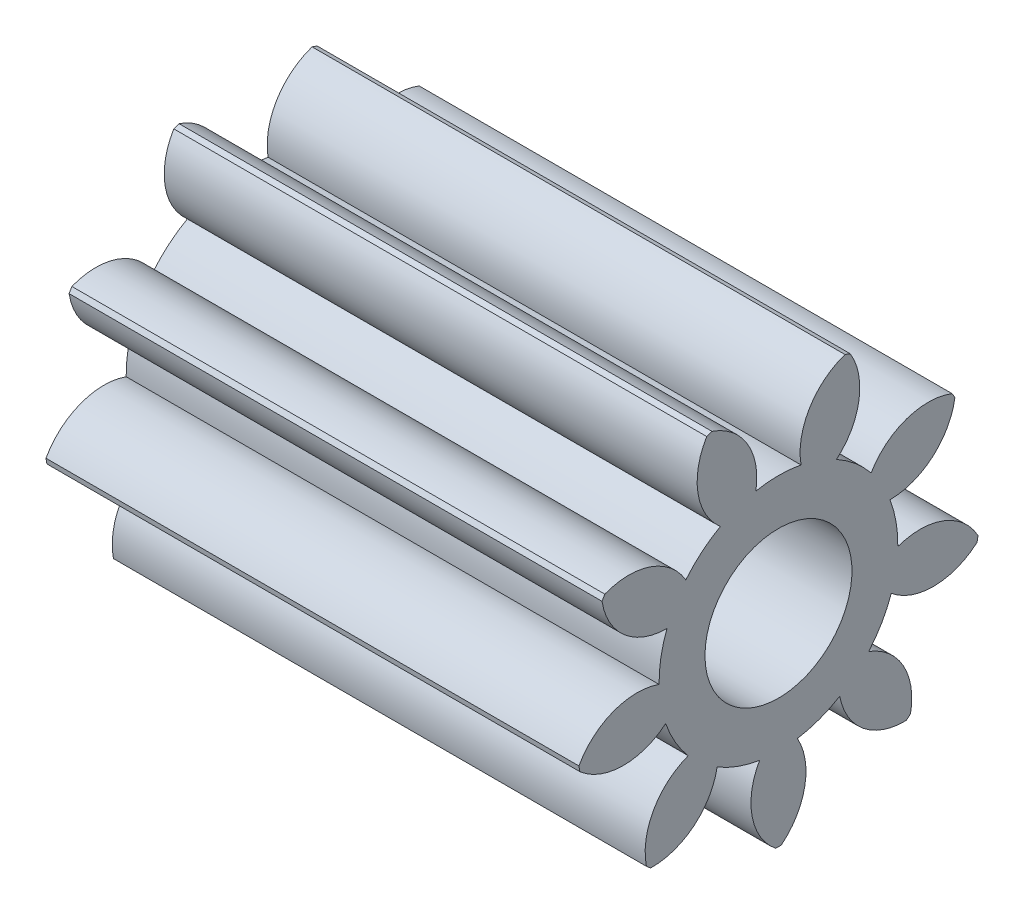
ISO-10303-21;
HEADER;
FILE_DESCRIPTION(('STEP AP214'),'2;1');
FILE_NAME('part.step','',(''),(''),'','','');
FILE_SCHEMA(('AUTOMOTIVE_DESIGN { 1 0 10303 214 1 1 1 1 }'));
ENDSEC;
DATA;
#1=APPLICATION_CONTEXT('core data for automotive mechanical design processes');
#2=APPLICATION_PROTOCOL_DEFINITION('international standard','automotive_design',2000,#1);
#3=PRODUCT_CONTEXT('',#1,'mechanical');
#4=PRODUCT('Part','Part','',(#3));
#5=PRODUCT_RELATED_PRODUCT_CATEGORY('part','',(#4));
#6=PRODUCT_DEFINITION_FORMATION('','',#4);
#7=PRODUCT_DEFINITION_CONTEXT('part definition',#1,'design');
#8=PRODUCT_DEFINITION('design','',#6,#7);
#9=PRODUCT_DEFINITION_SHAPE('','',#8);
#10=(LENGTH_UNIT() NAMED_UNIT(*) SI_UNIT(.MILLI.,.METRE.));
#11=(NAMED_UNIT(*) PLANE_ANGLE_UNIT() SI_UNIT($,.RADIAN.));
#12=(NAMED_UNIT(*) SI_UNIT($,.STERADIAN.) SOLID_ANGLE_UNIT());
#13=UNCERTAINTY_MEASURE_WITH_UNIT(LENGTH_MEASURE(1.E-05),#10,'distance_accuracy_value','');
#14=(GEOMETRIC_REPRESENTATION_CONTEXT(3) GLOBAL_UNCERTAINTY_ASSIGNED_CONTEXT((#13)) GLOBAL_UNIT_ASSIGNED_CONTEXT((#10,
#11,#12)) REPRESENTATION_CONTEXT('',''));
#15=CARTESIAN_POINT('',(0.,0.,0.));
#16=DIRECTION('',(0.,0.,1.));
#17=DIRECTION('',(1.,0.,0.));
#18=AXIS2_PLACEMENT_3D('',#15,#16,#17);
#19=CARTESIAN_POINT('',(7.25,0.,0.));
#20=DIRECTION('',(-1.,0.,0.));
#21=DIRECTION('',(0.,0.,1.));
#22=AXIS2_PLACEMENT_3D('',#19,#20,#21);
#23=PLANE('',#22);
#24=CARTESIAN_POINT('',(7.25,0.568726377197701,-2.03638166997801));
#25=DIRECTION('',(-1.,0.,0.));
#26=DIRECTION('',(0.,-0.64278760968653,-0.766044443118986));
#27=AXIS2_PLACEMENT_3D('',#24,#25,#26);
#28=CIRCLE('',#27,0.899999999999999);
#29=CARTESIAN_POINT('',(7.25,1.02432064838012,-1.26021554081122));
#30=VERTEX_POINT('',#29);
#31=CARTESIAN_POINT('',(7.25,1.4075779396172,-2.36246150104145));
#32=VERTEX_POINT('',#31);
#33=EDGE_CURVE('E276',#30,#32,#28,.T.);
#34=ORIENTED_EDGE('',*,*,#33,.F.);
#35=CARTESIAN_POINT('',(7.25,0.,0.));
#36=DIRECTION('',(-1.,0.,0.));
#37=DIRECTION('',(0.,-0.64278760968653,-0.766044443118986));
#38=AXIS2_PLACEMENT_3D('',#35,#36,#37);
#39=CIRCLE('',#38,1.624);
#40=CARTESIAN_POINT('',(7.25,1.4189414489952,-0.78992478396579));
#41=VERTEX_POINT('',#40);
#42=EDGE_CURVE('E477',#41,#30,#39,.T.);
#43=ORIENTED_EDGE('',*,*,#42,.F.);
#44=CARTESIAN_POINT('',(7.25,2.1042027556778,-0.206472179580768));
#45=DIRECTION('',(-1.,0.,0.));
#46=DIRECTION('',(0.,-0.64278760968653,-0.766044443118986));
#47=AXIS2_PLACEMENT_3D('',#44,#45,#46);
#48=CIRCLE('',#47,0.899999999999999);
#49=CARTESIAN_POINT('',(7.25,2.5709937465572,-0.975956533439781));
#50=VERTEX_POINT('',#49);
#51=EDGE_CURVE('E266',#50,#41,#48,.T.);
#52=ORIENTED_EDGE('',*,*,#51,.F.);
#53=CARTESIAN_POINT('',(7.25,0.,0.));
#54=DIRECTION('',(-1.,0.,0.));
#55=DIRECTION('',(0.,0.,1.));
#56=AXIS2_PLACEMENT_3D('',#53,#54,#55);
#57=CIRCLE('',#56,2.75);
#58=CARTESIAN_POINT('',(7.25,2.59682824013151,-0.904976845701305));
#59=VERTEX_POINT('',#58);
#60=EDGE_CURVE('E294',#59,#50,#57,.T.);
#61=ORIENTED_EDGE('',*,*,#60,.F.);
#62=CARTESIAN_POINT('',(7.25,1.74463058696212,-1.19438859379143));
#63=DIRECTION('',(-1.,0.,0.));
#64=DIRECTION('',(0.,0.,-1.));
#65=AXIS2_PLACEMENT_3D('',#62,#63,#64);
#66=CIRCLE('',#65,0.899999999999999);
#67=CARTESIAN_POINT('',(7.25,1.59472607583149,-0.306960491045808));
#68=VERTEX_POINT('',#67);
#69=EDGE_CURVE('E318',#68,#59,#66,.T.);
#70=ORIENTED_EDGE('',*,*,#69,.F.);
#71=CARTESIAN_POINT('',(7.25,0.,0.));
#72=DIRECTION('',(-1.,0.,0.));
#73=DIRECTION('',(0.,0.,-1.));
#74=AXIS2_PLACEMENT_3D('',#71,#72,#73);
#75=CIRCLE('',#74,1.624);
#76=CARTESIAN_POINT('',(7.25,1.59472607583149,0.306960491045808));
#77=VERTEX_POINT('',#76);
#78=EDGE_CURVE('E314',#77,#68,#75,.T.);
#79=ORIENTED_EDGE('',*,*,#78,.F.);
#80=CARTESIAN_POINT('',(7.25,1.74463058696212,1.19438859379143));
#81=DIRECTION('',(-1.,0.,0.));
#82=DIRECTION('',(0.,0.,-1.));
#83=AXIS2_PLACEMENT_3D('',#80,#81,#82);
#84=CIRCLE('',#83,0.899999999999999);
#85=CARTESIAN_POINT('',(7.25,2.59682824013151,0.904976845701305));
#86=VERTEX_POINT('',#85);
#87=EDGE_CURVE('E316',#86,#77,#84,.T.);
#88=ORIENTED_EDGE('',*,*,#87,.F.);
#89=CARTESIAN_POINT('',(7.25,2.57099374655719,0.975956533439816));
#90=VERTEX_POINT('',#89);
#91=EDGE_CURVE('E288',#90,#86,#57,.T.);
#92=ORIENTED_EDGE('',*,*,#91,.F.);
#93=CARTESIAN_POINT('',(7.25,2.10420275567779,0.206472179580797));
#94=DIRECTION('',(-1.,0.,0.));
#95=DIRECTION('',(0.,0.642787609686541,-0.766044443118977));
#96=AXIS2_PLACEMENT_3D('',#93,#94,#95);
#97=CIRCLE('',#96,0.899999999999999);
#98=CARTESIAN_POINT('',(7.25,1.41894144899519,0.789924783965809));
#99=VERTEX_POINT('',#98);
#100=EDGE_CURVE('E337',#99,#90,#97,.T.);
#101=ORIENTED_EDGE('',*,*,#100,.F.);
#102=CARTESIAN_POINT('',(7.25,0.,0.));
#103=DIRECTION('',(-1.,0.,0.));
#104=DIRECTION('',(0.,0.642787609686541,-0.766044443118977));
#105=AXIS2_PLACEMENT_3D('',#102,#103,#104);
#106=CIRCLE('',#105,1.624);
#107=CARTESIAN_POINT('',(7.25,1.02432064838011,1.26021554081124));
#108=VERTEX_POINT('',#107);
#109=EDGE_CURVE('E333',#108,#99,#106,.T.);
#110=ORIENTED_EDGE('',*,*,#109,.F.);
#111=CARTESIAN_POINT('',(7.25,0.568726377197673,2.03638166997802));
#112=DIRECTION('',(-1.,0.,0.));
#113=DIRECTION('',(0.,0.642787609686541,-0.766044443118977));
#114=AXIS2_PLACEMENT_3D('',#111,#112,#113);
#115=CIRCLE('',#114,0.899999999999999);
#116=CARTESIAN_POINT('',(7.25,1.40757793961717,2.36246150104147));
#117=VERTEX_POINT('',#116);
#118=EDGE_CURVE('E335',#117,#108,#115,.T.);
#119=ORIENTED_EDGE('',*,*,#118,.F.);
#120=CARTESIAN_POINT('',(7.25,1.34216270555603,2.40022900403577));
#121=VERTEX_POINT('',#120);
#122=EDGE_CURVE('E292',#121,#117,#57,.T.);
#123=ORIENTED_EDGE('',*,*,#122,.F.);
#124=CARTESIAN_POINT('',(7.25,1.4791950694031,1.51072232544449));
#125=DIRECTION('',(-1.,0.,0.));
#126=DIRECTION('',(0.,0.984807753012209,-0.173648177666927));
#127=AXIS2_PLACEMENT_3D('',#124,#125,#126);
#128=CIRCLE('',#127,0.899999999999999);
#129=CARTESIAN_POINT('',(7.25,0.579218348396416,1.51719547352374));
#130=VERTEX_POINT('',#129);
#131=EDGE_CURVE('E358',#130,#121,#128,.T.);
#132=ORIENTED_EDGE('',*,*,#131,.F.);
#133=CARTESIAN_POINT('',(7.25,0.,0.));
#134=DIRECTION('',(-1.,0.,0.));
#135=DIRECTION('',(0.,0.984807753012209,-0.173648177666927));
#136=AXIS2_PLACEMENT_3D('',#133,#134,#135);
#137=CIRCLE('',#136,1.624);
#138=CARTESIAN_POINT('',(7.25,-0.0253757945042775,1.62380173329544));
#139=VERTEX_POINT('',#138);
#140=EDGE_CURVE('E354',#139,#130,#137,.T.);
#141=ORIENTED_EDGE('',*,*,#140,.F.);
#142=CARTESIAN_POINT('',(7.25,-0.873291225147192,1.92552913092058));
#143=DIRECTION('',(-1.,0.,0.));
#144=DIRECTION('',(0.,0.984807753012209,-0.173648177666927));
#145=AXIS2_PLACEMENT_3D('',#142,#143,#144);
#146=CIRCLE('',#145,0.899999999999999);
#147=CARTESIAN_POINT('',(7.25,-0.440293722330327,2.71452416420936));
#148=VERTEX_POINT('',#147);
#149=EDGE_CURVE('E356',#148,#139,#146,.T.);
#150=ORIENTED_EDGE('',*,*,#149,.F.);
#151=CARTESIAN_POINT('',(7.25,-0.514681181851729,2.70140764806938));
#152=VERTEX_POINT('',#151);
#153=EDGE_CURVE('E583',#152,#148,#57,.T.);
#154=ORIENTED_EDGE('',*,*,#153,.F.);
#155=CARTESIAN_POINT('',(7.25,0.162055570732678,2.10808870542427));
#156=DIRECTION('',(-1.,0.,0.));
#157=DIRECTION('',(0.,0.866025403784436,0.500000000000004));
#158=AXIS2_PLACEMENT_3D('',#155,#156,#157);
#159=CIRCLE('',#158,0.899999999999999);
#160=CARTESIAN_POINT('',(7.25,-0.531527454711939,1.53455353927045));
#161=VERTEX_POINT('',#160);
#162=EDGE_CURVE('E380',#161,#152,#159,.T.);
#163=ORIENTED_EDGE('',*,*,#162,.F.);
#164=CARTESIAN_POINT('',(7.25,0.,0.));
#165=DIRECTION('',(-1.,0.,0.));
#166=DIRECTION('',(0.,0.866025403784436,0.500000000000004));
#167=AXIS2_PLACEMENT_3D('',#164,#165,#166);
#168=CIRCLE('',#167,1.624);
#169=CARTESIAN_POINT('',(7.25,-1.06319862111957,1.22759304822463));
#170=VERTEX_POINT('',#169);
#171=EDGE_CURVE('E376',#170,#161,#168,.T.);
#172=ORIENTED_EDGE('',*,*,#171,.F.);
#173=CARTESIAN_POINT('',(7.25,-1.90668615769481,0.913700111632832));
#174=DIRECTION('',(-1.,0.,0.));
#175=DIRECTION('',(0.,0.866025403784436,0.500000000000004));
#176=AXIS2_PLACEMENT_3D('',#173,#174,#175);
#177=CIRCLE('',#176,0.899999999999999);
#178=CARTESIAN_POINT('',(7.25,-2.0821470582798,1.79643080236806));
#179=VERTEX_POINT('',#178);
#180=EDGE_CURVE('E378',#179,#170,#177,.T.);
#181=ORIENTED_EDGE('',*,*,#180,.F.);
#182=CARTESIAN_POINT('',(7.25,-2.13070002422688,1.73856763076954));
#183=VERTEX_POINT('',#182);
#184=EDGE_CURVE('E578',#183,#179,#57,.T.);
#185=ORIENTED_EDGE('',*,*,#184,.F.);
#186=CARTESIAN_POINT('',(7.25,-1.23091153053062,1.71905695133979));
#187=DIRECTION('',(-1.,0.,0.));
#188=DIRECTION('',(0.,0.342020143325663,0.939692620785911));
#189=AXIS2_PLACEMENT_3D('',#186,#187,#188);
#190=CIRCLE('',#189,0.899999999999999);
#191=CARTESIAN_POINT('',(7.25,-1.39356565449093,0.833876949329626));
#192=VERTEX_POINT('',#191);
#193=EDGE_CURVE('E402',#192,#183,#190,.T.);
#194=ORIENTED_EDGE('',*,*,#193,.F.);
#195=CARTESIAN_POINT('',(7.25,0.,0.));
#196=DIRECTION('',(-1.,0.,0.));
#197=DIRECTION('',(0.,0.342020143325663,0.939692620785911));
#198=AXIS2_PLACEMENT_3D('',#195,#196,#197);
#199=CIRCLE('',#198,1.624);
#200=CARTESIAN_POINT('',(7.25,-1.60353899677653,0.256979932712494));
#201=VERTEX_POINT('',#200);
#202=EDGE_CURVE('E398',#201,#192,#199,.T.);
#203=ORIENTED_EDGE('',*,*,#202,.F.);
#204=CARTESIAN_POINT('',(7.25,-2.04792144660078,-0.525659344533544));
#205=DIRECTION('',(-1.,0.,0.));
#206=DIRECTION('',(0.,0.342020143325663,0.939692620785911));
#207=AXIS2_PLACEMENT_3D('',#204,#205,#206);
#208=CIRCLE('',#207,0.899999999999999);
#209=CARTESIAN_POINT('',(7.25,-2.74974064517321,0.0377675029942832));
#210=VERTEX_POINT('',#209);
#211=EDGE_CURVE('E400',#210,#201,#208,.T.);
#212=ORIENTED_EDGE('',*,*,#211,.F.);
#213=CARTESIAN_POINT('',(7.25,-2.74974064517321,-0.0377675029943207));
#214=VERTEX_POINT('',#213);
#215=EDGE_CURVE('E573',#214,#210,#57,.T.);
#216=ORIENTED_EDGE('',*,*,#215,.F.);
#217=CARTESIAN_POINT('',(7.25,-2.04792144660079,0.525659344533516));
#218=DIRECTION('',(-1.,0.,0.));
#219=DIRECTION('',(0.,-0.342020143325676,0.939692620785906));
#220=AXIS2_PLACEMENT_3D('',#217,#218,#219);
#221=CIRCLE('',#220,0.899999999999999);
#222=CARTESIAN_POINT('',(7.25,-1.60353899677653,-0.256979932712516));
#223=VERTEX_POINT('',#222);
#224=EDGE_CURVE('E424',#223,#214,#221,.T.);
#225=ORIENTED_EDGE('',*,*,#224,.F.);
#226=CARTESIAN_POINT('',(7.25,0.,0.));
#227=DIRECTION('',(-1.,0.,0.));
#228=DIRECTION('',(0.,-0.342020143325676,0.939692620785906));
#229=AXIS2_PLACEMENT_3D('',#226,#227,#228);
#230=CIRCLE('',#229,1.624);
#231=CARTESIAN_POINT('',(7.25,-1.39356565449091,-0.833876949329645));
#232=VERTEX_POINT('',#231);
#233=EDGE_CURVE('E420',#232,#223,#230,.T.);
#234=ORIENTED_EDGE('',*,*,#233,.F.);
#235=CARTESIAN_POINT('',(7.25,-1.23091153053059,-1.7190569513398));
#236=DIRECTION('',(-1.,0.,0.));
#237=DIRECTION('',(0.,-0.342020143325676,0.939692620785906));
#238=AXIS2_PLACEMENT_3D('',#235,#236,#237);
#239=CIRCLE('',#238,0.899999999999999);
#240=CARTESIAN_POINT('',(7.25,-2.13070002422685,-1.73856763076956));
#241=VERTEX_POINT('',#240);
#242=EDGE_CURVE('E422',#241,#232,#239,.T.);
#243=ORIENTED_EDGE('',*,*,#242,.F.);
#244=CARTESIAN_POINT('',(7.25,-2.08214705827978,-1.79643080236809));
#245=VERTEX_POINT('',#244);
#246=EDGE_CURVE('E568',#245,#241,#57,.T.);
#247=ORIENTED_EDGE('',*,*,#246,.F.);
#248=CARTESIAN_POINT('',(7.25,-1.9066861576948,-0.913700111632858));
#249=DIRECTION('',(-1.,0.,0.));
#250=DIRECTION('',(0.,-0.866025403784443,0.499999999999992));
#251=AXIS2_PLACEMENT_3D('',#248,#249,#250);
#252=CIRCLE('',#251,0.899999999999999);
#253=CARTESIAN_POINT('',(7.25,-1.06319862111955,-1.22759304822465));
#254=VERTEX_POINT('',#253);
#255=EDGE_CURVE('E446',#254,#245,#252,.T.);
#256=ORIENTED_EDGE('',*,*,#255,.F.);
#257=CARTESIAN_POINT('',(7.25,0.,0.));
#258=DIRECTION('',(-1.,0.,0.));
#259=DIRECTION('',(0.,-0.866025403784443,0.499999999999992));
#260=AXIS2_PLACEMENT_3D('',#257,#258,#259);
#261=CIRCLE('',#260,1.624);
#262=CARTESIAN_POINT('',(7.25,-0.531527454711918,-1.53455353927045));
#263=VERTEX_POINT('',#262);
#264=EDGE_CURVE('E442',#263,#254,#261,.T.);
#265=ORIENTED_EDGE('',*,*,#264,.F.);
#266=CARTESIAN_POINT('',(7.25,0.162055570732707,-2.10808870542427));
#267=DIRECTION('',(-1.,0.,0.));
#268=DIRECTION('',(0.,-0.866025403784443,0.499999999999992));
#269=AXIS2_PLACEMENT_3D('',#266,#267,#268);
#270=CIRCLE('',#269,0.899999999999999);
#271=CARTESIAN_POINT('',(7.25,-0.514681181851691,-2.70140764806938));
#272=VERTEX_POINT('',#271);
#273=EDGE_CURVE('E444',#272,#263,#270,.T.);
#274=ORIENTED_EDGE('',*,*,#273,.F.);
#275=CARTESIAN_POINT('',(7.25,-0.440293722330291,-2.71452416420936));
#276=VERTEX_POINT('',#275);
#277=EDGE_CURVE('E567',#276,#272,#57,.T.);
#278=ORIENTED_EDGE('',*,*,#277,.F.);
#279=CARTESIAN_POINT('',(7.25,-0.873291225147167,-1.92552913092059));
#280=DIRECTION('',(-1.,0.,0.));
#281=DIRECTION('',(0.,-0.984807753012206,-0.17364817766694));
#282=AXIS2_PLACEMENT_3D('',#279,#280,#281);
#283=CIRCLE('',#282,0.899999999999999);
#284=CARTESIAN_POINT('',(7.25,-0.0253757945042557,-1.62380173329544));
#285=VERTEX_POINT('',#284);
#286=EDGE_CURVE('E467',#285,#276,#283,.T.);
#287=ORIENTED_EDGE('',*,*,#286,.F.);
#288=CARTESIAN_POINT('',(7.25,0.,0.));
#289=DIRECTION('',(-1.,0.,0.));
#290=DIRECTION('',(0.,-0.984807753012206,-0.17364817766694));
#291=AXIS2_PLACEMENT_3D('',#288,#289,#290);
#292=CIRCLE('',#291,1.624);
#293=CARTESIAN_POINT('',(7.25,0.579218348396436,-1.51719547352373));
#294=VERTEX_POINT('',#293);
#295=EDGE_CURVE('E463',#294,#285,#292,.T.);
#296=ORIENTED_EDGE('',*,*,#295,.F.);
#297=CARTESIAN_POINT('',(7.25,1.47919506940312,-1.51072232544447));
#298=DIRECTION('',(-1.,0.,0.));
#299=DIRECTION('',(0.,-0.984807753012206,-0.17364817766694));
#300=AXIS2_PLACEMENT_3D('',#297,#298,#299);
#301=CIRCLE('',#300,0.899999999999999);
#302=CARTESIAN_POINT('',(7.25,1.34216270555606,-2.40022900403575));
#303=VERTEX_POINT('',#302);
#304=EDGE_CURVE('E465',#303,#294,#301,.T.);
#305=ORIENTED_EDGE('',*,*,#304,.F.);
#306=EDGE_CURVE('E540',#32,#303,#57,.T.);
#307=ORIENTED_EDGE('',*,*,#306,.F.);
#308=EDGE_LOOP('',(#34,#43,#52,#61,#70,#79,#88,#92,#101,#110,#119,#123,#132,#141,#150,#154,#163,
#172,#181,#185,#194,#203,#212,#216,#225,#234,#243,#247,#256,#265,#274,#278,#287,#296,#305,#307));
#309=FACE_BOUND('',#308,.T.);
#310=CARTESIAN_POINT('',(7.25,0.,0.));
#311=DIRECTION('',(-1.,0.,0.));
#312=DIRECTION('',(0.,0.,1.));
#313=AXIS2_PLACEMENT_3D('',#310,#311,#312);
#314=CIRCLE('',#313,0.999999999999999);
#315=CARTESIAN_POINT('',(7.25,0.,0.999999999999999));
#316=VERTEX_POINT('',#315);
#317=EDGE_CURVE('E482',#316,#316,#314,.F.);
#318=ORIENTED_EDGE('',*,*,#317,.F.);
#319=EDGE_LOOP('',(#318));
#320=FACE_BOUND('',#319,.T.);
#321=ADVANCED_FACE('F27',(#309,#320),#23,.F.);
#322=CARTESIAN_POINT('',(0.,0.,0.));
#323=DIRECTION('',(1.,0.,0.));
#324=DIRECTION('',(0.,0.,-1.));
#325=AXIS2_PLACEMENT_3D('',#322,#323,#324);
#326=PLANE('',#325);
#327=CARTESIAN_POINT('',(0.,0.568726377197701,-2.03638166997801));
#328=DIRECTION('',(-1.,0.,0.));
#329=DIRECTION('',(0.,-0.64278760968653,-0.766044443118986));
#330=AXIS2_PLACEMENT_3D('',#327,#328,#329);
#331=CIRCLE('',#330,0.899999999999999);
#332=CARTESIAN_POINT('',(0.,1.02432064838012,-1.26021554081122));
#333=VERTEX_POINT('',#332);
#334=CARTESIAN_POINT('',(0.,1.4075779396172,-2.36246150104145));
#335=VERTEX_POINT('',#334);
#336=EDGE_CURVE('E42',#333,#335,#331,.T.);
#337=ORIENTED_EDGE('',*,*,#336,.T.);
#338=CARTESIAN_POINT('',(0.,0.,0.));
#339=DIRECTION('',(-1.,0.,0.));
#340=DIRECTION('',(0.,0.,1.));
#341=AXIS2_PLACEMENT_3D('',#338,#339,#340);
#342=CIRCLE('',#341,2.75);
#343=CARTESIAN_POINT('',(0.,1.34216270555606,-2.40022900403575));
#344=VERTEX_POINT('',#343);
#345=EDGE_CURVE('E289',#335,#344,#342,.T.);
#346=ORIENTED_EDGE('',*,*,#345,.T.);
#347=CARTESIAN_POINT('',(0.,1.47919506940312,-1.51072232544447));
#348=DIRECTION('',(1.,0.,0.));
#349=DIRECTION('',(0.,0.,-1.));
#350=AXIS2_PLACEMENT_3D('',#347,#348,#349);
#351=CIRCLE('',#350,0.899999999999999);
#352=CARTESIAN_POINT('',(0.,0.579218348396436,-1.51719547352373));
#353=VERTEX_POINT('',#352);
#354=EDGE_CURVE('E35',#353,#344,#351,.T.);
#355=ORIENTED_EDGE('',*,*,#354,.F.);
#356=CARTESIAN_POINT('',(0.,0.,0.));
#357=DIRECTION('',(-1.,0.,0.));
#358=DIRECTION('',(0.,-0.984807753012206,-0.17364817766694));
#359=AXIS2_PLACEMENT_3D('',#356,#357,#358);
#360=CIRCLE('',#359,1.624);
#361=CARTESIAN_POINT('',(0.,-0.0253757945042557,-1.62380173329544));
#362=VERTEX_POINT('',#361);
#363=EDGE_CURVE('E469',#353,#362,#360,.T.);
#364=ORIENTED_EDGE('',*,*,#363,.T.);
#365=CARTESIAN_POINT('',(0.,-0.873291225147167,-1.92552913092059));
#366=DIRECTION('',(-1.,0.,0.));
#367=DIRECTION('',(0.,-0.984807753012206,-0.17364817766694));
#368=AXIS2_PLACEMENT_3D('',#365,#366,#367);
#369=CIRCLE('',#368,0.899999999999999);
#370=CARTESIAN_POINT('',(0.,-0.440293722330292,-2.71452416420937));
#371=VERTEX_POINT('',#370);
#372=EDGE_CURVE('E50',#362,#371,#369,.T.);
#373=ORIENTED_EDGE('',*,*,#372,.T.);
#374=CARTESIAN_POINT('',(0.,-0.51468118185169,-2.70140764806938));
#375=VERTEX_POINT('',#374);
#376=EDGE_CURVE('E295',#371,#375,#342,.T.);
#377=ORIENTED_EDGE('',*,*,#376,.T.);
#378=CARTESIAN_POINT('',(0.,0.162055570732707,-2.10808870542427));
#379=DIRECTION('',(1.,0.,0.));
#380=DIRECTION('',(0.,0.,-1.));
#381=AXIS2_PLACEMENT_3D('',#378,#379,#380);
#382=CIRCLE('',#381,0.899999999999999);
#383=CARTESIAN_POINT('',(0.,-0.531527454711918,-1.53455353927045));
#384=VERTEX_POINT('',#383);
#385=EDGE_CURVE('E553',#384,#375,#382,.T.);
#386=ORIENTED_EDGE('',*,*,#385,.F.);
#387=CARTESIAN_POINT('',(0.,0.,0.));
#388=DIRECTION('',(-1.,0.,0.));
#389=DIRECTION('',(0.,-0.866025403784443,0.499999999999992));
#390=AXIS2_PLACEMENT_3D('',#387,#388,#389);
#391=CIRCLE('',#390,1.624);
#392=CARTESIAN_POINT('',(0.,-1.06319862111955,-1.22759304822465));
#393=VERTEX_POINT('',#392);
#394=EDGE_CURVE('E448',#384,#393,#391,.T.);
#395=ORIENTED_EDGE('',*,*,#394,.T.);
#396=CARTESIAN_POINT('',(0.,-1.9066861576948,-0.913700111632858));
#397=DIRECTION('',(-1.,0.,0.));
#398=DIRECTION('',(0.,-0.866025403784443,0.499999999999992));
#399=AXIS2_PLACEMENT_3D('',#396,#397,#398);
#400=CIRCLE('',#399,0.899999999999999);
#401=CARTESIAN_POINT('',(0.,-2.08214705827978,-1.79643080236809));
#402=VERTEX_POINT('',#401);
#403=EDGE_CURVE('E451',#393,#402,#400,.T.);
#404=ORIENTED_EDGE('',*,*,#403,.T.);
#405=CARTESIAN_POINT('',(0.,-2.13070002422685,-1.73856763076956));
#406=VERTEX_POINT('',#405);
#407=EDGE_CURVE('E625',#402,#406,#342,.T.);
#408=ORIENTED_EDGE('',*,*,#407,.T.);
#409=CARTESIAN_POINT('',(0.,-1.23091153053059,-1.7190569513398));
#410=DIRECTION('',(1.,0.,0.));
#411=DIRECTION('',(0.,0.,-1.));
#412=AXIS2_PLACEMENT_3D('',#409,#410,#411);
#413=CIRCLE('',#412,0.899999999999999);
#414=CARTESIAN_POINT('',(0.,-1.39356565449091,-0.833876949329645));
#415=VERTEX_POINT('',#414);
#416=EDGE_CURVE('E550',#415,#406,#413,.T.);
#417=ORIENTED_EDGE('',*,*,#416,.F.);
#418=CARTESIAN_POINT('',(0.,0.,0.));
#419=DIRECTION('',(-1.,0.,0.));
#420=DIRECTION('',(0.,-0.342020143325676,0.939692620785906));
#421=AXIS2_PLACEMENT_3D('',#418,#419,#420);
#422=CIRCLE('',#421,1.624);
#423=CARTESIAN_POINT('',(0.,-1.60353899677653,-0.256979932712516));
#424=VERTEX_POINT('',#423);
#425=EDGE_CURVE('E426',#415,#424,#422,.T.);
#426=ORIENTED_EDGE('',*,*,#425,.T.);
#427=CARTESIAN_POINT('',(0.,-2.04792144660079,0.525659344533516));
#428=DIRECTION('',(-1.,0.,0.));
#429=DIRECTION('',(0.,-0.342020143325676,0.939692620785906));
#430=AXIS2_PLACEMENT_3D('',#427,#428,#429);
#431=CIRCLE('',#430,0.899999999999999);
#432=CARTESIAN_POINT('',(0.,-2.74974064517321,-0.0377675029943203));
#433=VERTEX_POINT('',#432);
#434=EDGE_CURVE('E429',#424,#433,#431,.T.);
#435=ORIENTED_EDGE('',*,*,#434,.T.);
#436=CARTESIAN_POINT('',(0.,-2.74974064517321,0.0377675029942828));
#437=VERTEX_POINT('',#436);
#438=EDGE_CURVE('E622',#433,#437,#342,.T.);
#439=ORIENTED_EDGE('',*,*,#438,.T.);
#440=CARTESIAN_POINT('',(0.,-2.04792144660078,-0.525659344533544));
#441=DIRECTION('',(1.,0.,0.));
#442=DIRECTION('',(0.,0.,-1.));
#443=AXIS2_PLACEMENT_3D('',#440,#441,#442);
#444=CIRCLE('',#443,0.899999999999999);
#445=CARTESIAN_POINT('',(0.,-1.60353899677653,0.256979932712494));
#446=VERTEX_POINT('',#445);
#447=EDGE_CURVE('E547',#446,#437,#444,.T.);
#448=ORIENTED_EDGE('',*,*,#447,.F.);
#449=CARTESIAN_POINT('',(0.,0.,0.));
#450=DIRECTION('',(-1.,0.,0.));
#451=DIRECTION('',(0.,0.342020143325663,0.939692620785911));
#452=AXIS2_PLACEMENT_3D('',#449,#450,#451);
#453=CIRCLE('',#452,1.624);
#454=CARTESIAN_POINT('',(0.,-1.39356565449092,0.833876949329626));
#455=VERTEX_POINT('',#454);
#456=EDGE_CURVE('E404',#446,#455,#453,.T.);
#457=ORIENTED_EDGE('',*,*,#456,.T.);
#458=CARTESIAN_POINT('',(0.,-1.23091153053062,1.71905695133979));
#459=DIRECTION('',(-1.,0.,0.));
#460=DIRECTION('',(0.,0.342020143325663,0.939692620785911));
#461=AXIS2_PLACEMENT_3D('',#458,#459,#460);
#462=CIRCLE('',#461,0.899999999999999);
#463=CARTESIAN_POINT('',(0.,-2.13070002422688,1.73856763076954));
#464=VERTEX_POINT('',#463);
#465=EDGE_CURVE('E407',#455,#464,#462,.T.);
#466=ORIENTED_EDGE('',*,*,#465,.T.);
#467=CARTESIAN_POINT('',(0.,-2.0821470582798,1.79643080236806));
#468=VERTEX_POINT('',#467);
#469=EDGE_CURVE('E621',#464,#468,#342,.T.);
#470=ORIENTED_EDGE('',*,*,#469,.T.);
#471=CARTESIAN_POINT('',(0.,-1.90668615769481,0.913700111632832));
#472=DIRECTION('',(1.,0.,0.));
#473=DIRECTION('',(0.,0.,-1.));
#474=AXIS2_PLACEMENT_3D('',#471,#472,#473);
#475=CIRCLE('',#474,0.899999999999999);
#476=CARTESIAN_POINT('',(0.,-1.06319862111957,1.22759304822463));
#477=VERTEX_POINT('',#476);
#478=EDGE_CURVE('E544',#477,#468,#475,.T.);
#479=ORIENTED_EDGE('',*,*,#478,.F.);
#480=CARTESIAN_POINT('',(0.,0.,0.));
#481=DIRECTION('',(-1.,0.,0.));
#482=DIRECTION('',(0.,0.866025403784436,0.500000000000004));
#483=AXIS2_PLACEMENT_3D('',#480,#481,#482);
#484=CIRCLE('',#483,1.624);
#485=CARTESIAN_POINT('',(0.,-0.531527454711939,1.53455353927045));
#486=VERTEX_POINT('',#485);
#487=EDGE_CURVE('E382',#477,#486,#484,.T.);
#488=ORIENTED_EDGE('',*,*,#487,.T.);
#489=CARTESIAN_POINT('',(0.,0.162055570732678,2.10808870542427));
#490=DIRECTION('',(-1.,0.,0.));
#491=DIRECTION('',(0.,0.866025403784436,0.500000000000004));
#492=AXIS2_PLACEMENT_3D('',#489,#490,#491);
#493=CIRCLE('',#492,0.899999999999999);
#494=CARTESIAN_POINT('',(0.,-0.514681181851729,2.70140764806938));
#495=VERTEX_POINT('',#494);
#496=EDGE_CURVE('E385',#486,#495,#493,.T.);
#497=ORIENTED_EDGE('',*,*,#496,.T.);
#498=CARTESIAN_POINT('',(0.,-0.440293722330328,2.71452416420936));
#499=VERTEX_POINT('',#498);
#500=EDGE_CURVE('E303',#495,#499,#342,.T.);
#501=ORIENTED_EDGE('',*,*,#500,.T.);
#502=CARTESIAN_POINT('',(0.,-0.873291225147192,1.92552913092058));
#503=DIRECTION('',(1.,0.,0.));
#504=DIRECTION('',(0.,0.,-1.));
#505=AXIS2_PLACEMENT_3D('',#502,#503,#504);
#506=CIRCLE('',#505,0.899999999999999);
#507=CARTESIAN_POINT('',(0.,-0.0253757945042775,1.62380173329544));
#508=VERTEX_POINT('',#507);
#509=EDGE_CURVE('E537',#508,#499,#506,.T.);
#510=ORIENTED_EDGE('',*,*,#509,.F.);
#511=CARTESIAN_POINT('',(0.,0.,0.));
#512=DIRECTION('',(-1.,0.,0.));
#513=DIRECTION('',(0.,0.984807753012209,-0.173648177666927));
#514=AXIS2_PLACEMENT_3D('',#511,#512,#513);
#515=CIRCLE('',#514,1.624);
#516=CARTESIAN_POINT('',(0.,0.579218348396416,1.51719547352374));
#517=VERTEX_POINT('',#516);
#518=EDGE_CURVE('E360',#508,#517,#515,.T.);
#519=ORIENTED_EDGE('',*,*,#518,.T.);
#520=CARTESIAN_POINT('',(0.,1.4791950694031,1.51072232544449));
#521=DIRECTION('',(-1.,0.,0.));
#522=DIRECTION('',(0.,0.984807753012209,-0.173648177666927));
#523=AXIS2_PLACEMENT_3D('',#520,#521,#522);
#524=CIRCLE('',#523,0.899999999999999);
#525=CARTESIAN_POINT('',(0.,1.34216270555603,2.40022900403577));
#526=VERTEX_POINT('',#525);
#527=EDGE_CURVE('E363',#517,#526,#524,.T.);
#528=ORIENTED_EDGE('',*,*,#527,.T.);
#529=CARTESIAN_POINT('',(0.,1.40757793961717,2.36246150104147));
#530=VERTEX_POINT('',#529);
#531=EDGE_CURVE('E297',#526,#530,#342,.T.);
#532=ORIENTED_EDGE('',*,*,#531,.T.);
#533=CARTESIAN_POINT('',(0.,0.568726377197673,2.03638166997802));
#534=DIRECTION('',(1.,0.,0.));
#535=DIRECTION('',(0.,0.,-1.));
#536=AXIS2_PLACEMENT_3D('',#533,#534,#535);
#537=CIRCLE('',#536,0.899999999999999);
#538=CARTESIAN_POINT('',(0.,1.02432064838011,1.26021554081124));
#539=VERTEX_POINT('',#538);
#540=EDGE_CURVE('E534',#539,#530,#537,.T.);
#541=ORIENTED_EDGE('',*,*,#540,.F.);
#542=CARTESIAN_POINT('',(0.,0.,0.));
#543=DIRECTION('',(-1.,0.,0.));
#544=DIRECTION('',(0.,0.642787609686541,-0.766044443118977));
#545=AXIS2_PLACEMENT_3D('',#542,#543,#544);
#546=CIRCLE('',#545,1.624);
#547=CARTESIAN_POINT('',(0.,1.41894144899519,0.789924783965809));
#548=VERTEX_POINT('',#547);
#549=EDGE_CURVE('E339',#539,#548,#546,.T.);
#550=ORIENTED_EDGE('',*,*,#549,.T.);
#551=CARTESIAN_POINT('',(0.,2.10420275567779,0.206472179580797));
#552=DIRECTION('',(-1.,0.,0.));
#553=DIRECTION('',(0.,0.642787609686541,-0.766044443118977));
#554=AXIS2_PLACEMENT_3D('',#551,#552,#553);
#555=CIRCLE('',#554,0.899999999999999);
#556=CARTESIAN_POINT('',(0.,2.57099374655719,0.975956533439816));
#557=VERTEX_POINT('',#556);
#558=EDGE_CURVE('E342',#548,#557,#555,.T.);
#559=ORIENTED_EDGE('',*,*,#558,.T.);
#560=CARTESIAN_POINT('',(0.,2.59682824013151,0.904976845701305));
#561=VERTEX_POINT('',#560);
#562=EDGE_CURVE('E291',#557,#561,#342,.T.);
#563=ORIENTED_EDGE('',*,*,#562,.T.);
#564=CARTESIAN_POINT('',(0.,1.74463058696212,1.19438859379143));
#565=DIRECTION('',(1.,0.,0.));
#566=DIRECTION('',(0.,0.,-1.));
#567=AXIS2_PLACEMENT_3D('',#564,#565,#566);
#568=CIRCLE('',#567,0.899999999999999);
#569=CARTESIAN_POINT('',(0.,1.59472607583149,0.306960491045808));
#570=VERTEX_POINT('',#569);
#571=EDGE_CURVE('E533',#570,#561,#568,.T.);
#572=ORIENTED_EDGE('',*,*,#571,.F.);
#573=CARTESIAN_POINT('',(0.,0.,0.));
#574=DIRECTION('',(-1.,0.,0.));
#575=DIRECTION('',(0.,0.,-1.));
#576=AXIS2_PLACEMENT_3D('',#573,#574,#575);
#577=CIRCLE('',#576,1.624);
#578=CARTESIAN_POINT('',(0.,1.59472607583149,-0.306960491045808));
#579=VERTEX_POINT('',#578);
#580=EDGE_CURVE('E320',#570,#579,#577,.T.);
#581=ORIENTED_EDGE('',*,*,#580,.T.);
#582=CARTESIAN_POINT('',(0.,1.74463058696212,-1.19438859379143));
#583=DIRECTION('',(-1.,0.,0.));
#584=DIRECTION('',(0.,0.,-1.));
#585=AXIS2_PLACEMENT_3D('',#582,#583,#584);
#586=CIRCLE('',#585,0.899999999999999);
#587=CARTESIAN_POINT('',(0.,2.59682824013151,-0.904976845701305));
#588=VERTEX_POINT('',#587);
#589=EDGE_CURVE('E285',#579,#588,#586,.T.);
#590=ORIENTED_EDGE('',*,*,#589,.T.);
#591=CARTESIAN_POINT('',(0.,2.5709937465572,-0.975956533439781));
#592=VERTEX_POINT('',#591);
#593=EDGE_CURVE('E283',#588,#592,#342,.T.);
#594=ORIENTED_EDGE('',*,*,#593,.T.);
#595=CARTESIAN_POINT('',(0.,2.1042027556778,-0.206472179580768));
#596=DIRECTION('',(1.,0.,0.));
#597=DIRECTION('',(0.,0.,-1.));
#598=AXIS2_PLACEMENT_3D('',#595,#596,#597);
#599=CIRCLE('',#598,0.899999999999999);
#600=CARTESIAN_POINT('',(0.,1.4189414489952,-0.78992478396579));
#601=VERTEX_POINT('',#600);
#602=EDGE_CURVE('E11',#601,#592,#599,.T.);
#603=ORIENTED_EDGE('',*,*,#602,.F.);
#604=CARTESIAN_POINT('',(0.,0.,0.));
#605=DIRECTION('',(-1.,0.,0.));
#606=DIRECTION('',(0.,-0.64278760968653,-0.766044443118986));
#607=AXIS2_PLACEMENT_3D('',#604,#605,#606);
#608=CIRCLE('',#607,1.624);
#609=EDGE_CURVE('E273',#601,#333,#608,.T.);
#610=ORIENTED_EDGE('',*,*,#609,.T.);
#611=EDGE_LOOP('',(#337,#346,#355,#364,#373,#377,#386,#395,#404,#408,#417,#426,#435,#439,#448,
#457,#466,#470,#479,#488,#497,#501,#510,#519,#528,#532,#541,#550,#559,#563,#572,#581,#590,#594,
#603,#610));
#612=FACE_BOUND('',#611,.T.);
#613=CARTESIAN_POINT('',(0.,0.,0.));
#614=DIRECTION('',(1.,0.,0.));
#615=DIRECTION('',(0.,0.,-1.));
#616=AXIS2_PLACEMENT_3D('',#613,#614,#615);
#617=CIRCLE('',#616,0.999999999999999);
#618=CARTESIAN_POINT('',(0.,0.,-0.999999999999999));
#619=VERTEX_POINT('',#618);
#620=EDGE_CURVE('E30',#619,#619,#617,.F.);
#621=ORIENTED_EDGE('',*,*,#620,.F.);
#622=EDGE_LOOP('',(#621));
#623=FACE_BOUND('',#622,.T.);
#624=ADVANCED_FACE('F279',(#612,#623),#326,.F.);
#625=CARTESIAN_POINT('',(-10.,0.,0.));
#626=DIRECTION('',(-1.,0.,0.));
#627=DIRECTION('',(0.,0.,1.));
#628=AXIS2_PLACEMENT_3D('',#625,#626,#627);
#629=CYLINDRICAL_SURFACE('',#628,2.75);
#630=DIRECTION('',(-1.,0.,0.));
#631=VECTOR('',#630,1.);
#632=CARTESIAN_POINT('',(3.625,1.4075779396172,-2.36246150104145));
#633=LINE('',#632,#631);
#634=EDGE_CURVE('E473',#32,#335,#633,.T.);
#635=ORIENTED_EDGE('',*,*,#634,.F.);
#636=ORIENTED_EDGE('',*,*,#306,.T.);
#637=DIRECTION('',(-1.,0.,0.));
#638=VECTOR('',#637,1.);
#639=CARTESIAN_POINT('',(3.625,1.34216270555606,-2.40022900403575));
#640=LINE('',#639,#638);
#641=EDGE_CURVE('E456',#344,#303,#640,.F.);
#642=ORIENTED_EDGE('',*,*,#641,.F.);
#643=ORIENTED_EDGE('',*,*,#345,.F.);
#644=EDGE_LOOP('',(#635,#636,#642,#643));
#645=FACE_BOUND('',#644,.T.);
#646=ADVANCED_FACE('F491',(#645),#629,.T.);
#647=DIRECTION('',(-1.,0.,0.));
#648=VECTOR('',#647,1.);
#649=CARTESIAN_POINT('',(3.625,2.5709937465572,-0.975956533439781));
#650=LINE('',#649,#648);
#651=EDGE_CURVE('E269',#592,#50,#650,.F.);
#652=ORIENTED_EDGE('',*,*,#651,.F.);
#653=ORIENTED_EDGE('',*,*,#593,.F.);
#654=DIRECTION('',(-1.,0.,0.));
#655=VECTOR('',#654,1.);
#656=CARTESIAN_POINT('',(3.625,2.59682824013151,-0.904976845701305));
#657=LINE('',#656,#655);
#658=EDGE_CURVE('E298',#59,#588,#657,.T.);
#659=ORIENTED_EDGE('',*,*,#658,.F.);
#660=ORIENTED_EDGE('',*,*,#60,.T.);
#661=EDGE_LOOP('',(#652,#653,#659,#660));
#662=FACE_BOUND('',#661,.T.);
#663=ADVANCED_FACE('F498',(#662),#629,.T.);
#664=DIRECTION('',(-1.,0.,0.));
#665=VECTOR('',#664,1.);
#666=CARTESIAN_POINT('',(3.625,-0.440293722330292,-2.71452416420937));
#667=LINE('',#666,#665);
#668=EDGE_CURVE('E454',#276,#371,#667,.T.);
#669=ORIENTED_EDGE('',*,*,#668,.F.);
#670=ORIENTED_EDGE('',*,*,#277,.T.);
#671=DIRECTION('',(-1.,0.,0.));
#672=VECTOR('',#671,1.);
#673=CARTESIAN_POINT('',(3.625,-0.514681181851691,-2.70140764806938));
#674=LINE('',#673,#672);
#675=EDGE_CURVE('E434',#375,#272,#674,.F.);
#676=ORIENTED_EDGE('',*,*,#675,.F.);
#677=ORIENTED_EDGE('',*,*,#376,.F.);
#678=EDGE_LOOP('',(#669,#670,#676,#677));
#679=FACE_BOUND('',#678,.T.);
#680=ADVANCED_FACE('F637',(#679),#629,.T.);
#681=DIRECTION('',(-1.,0.,0.));
#682=VECTOR('',#681,1.);
#683=CARTESIAN_POINT('',(3.625,-2.08214705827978,-1.79643080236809));
#684=LINE('',#683,#682);
#685=EDGE_CURVE('E432',#245,#402,#684,.T.);
#686=ORIENTED_EDGE('',*,*,#685,.F.);
#687=ORIENTED_EDGE('',*,*,#246,.T.);
#688=DIRECTION('',(-1.,0.,0.));
#689=VECTOR('',#688,1.);
#690=CARTESIAN_POINT('',(3.625,-2.13070002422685,-1.73856763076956));
#691=LINE('',#690,#689);
#692=EDGE_CURVE('E412',#406,#241,#691,.F.);
#693=ORIENTED_EDGE('',*,*,#692,.F.);
#694=ORIENTED_EDGE('',*,*,#407,.F.);
#695=EDGE_LOOP('',(#686,#687,#693,#694));
#696=FACE_BOUND('',#695,.T.);
#697=ADVANCED_FACE('F639',(#696),#629,.T.);
#698=DIRECTION('',(-1.,0.,0.));
#699=VECTOR('',#698,1.);
#700=CARTESIAN_POINT('',(3.625,-2.74974064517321,-0.0377675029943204));
#701=LINE('',#700,#699);
#702=EDGE_CURVE('E410',#214,#433,#701,.T.);
#703=ORIENTED_EDGE('',*,*,#702,.F.);
#704=ORIENTED_EDGE('',*,*,#215,.T.);
#705=DIRECTION('',(-1.,0.,0.));
#706=VECTOR('',#705,1.);
#707=CARTESIAN_POINT('',(3.625,-2.74974064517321,0.0377675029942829));
#708=LINE('',#707,#706);
#709=EDGE_CURVE('E390',#437,#210,#708,.F.);
#710=ORIENTED_EDGE('',*,*,#709,.F.);
#711=ORIENTED_EDGE('',*,*,#438,.F.);
#712=EDGE_LOOP('',(#703,#704,#710,#711));
#713=FACE_BOUND('',#712,.T.);
#714=ADVANCED_FACE('F644',(#713),#629,.T.);
#715=DIRECTION('',(-1.,0.,0.));
#716=VECTOR('',#715,1.);
#717=CARTESIAN_POINT('',(3.625,-2.13070002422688,1.73856763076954));
#718=LINE('',#717,#716);
#719=EDGE_CURVE('E388',#183,#464,#718,.T.);
#720=ORIENTED_EDGE('',*,*,#719,.F.);
#721=ORIENTED_EDGE('',*,*,#184,.T.);
#722=DIRECTION('',(-1.,0.,0.));
#723=VECTOR('',#722,1.);
#724=CARTESIAN_POINT('',(3.625,-2.0821470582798,1.79643080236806));
#725=LINE('',#724,#723);
#726=EDGE_CURVE('E368',#468,#179,#725,.F.);
#727=ORIENTED_EDGE('',*,*,#726,.F.);
#728=ORIENTED_EDGE('',*,*,#469,.F.);
#729=EDGE_LOOP('',(#720,#721,#727,#728));
#730=FACE_BOUND('',#729,.T.);
#731=ADVANCED_FACE('F858',(#730),#629,.T.);
#732=DIRECTION('',(-1.,0.,0.));
#733=VECTOR('',#732,1.);
#734=CARTESIAN_POINT('',(3.625,-0.514681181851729,2.70140764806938));
#735=LINE('',#734,#733);
#736=EDGE_CURVE('E366',#152,#495,#735,.T.);
#737=ORIENTED_EDGE('',*,*,#736,.F.);
#738=ORIENTED_EDGE('',*,*,#153,.T.);
#739=DIRECTION('',(-1.,0.,0.));
#740=VECTOR('',#739,1.);
#741=CARTESIAN_POINT('',(3.625,-0.440293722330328,2.71452416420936));
#742=LINE('',#741,#740);
#743=EDGE_CURVE('E346',#499,#148,#742,.F.);
#744=ORIENTED_EDGE('',*,*,#743,.F.);
#745=ORIENTED_EDGE('',*,*,#500,.F.);
#746=EDGE_LOOP('',(#737,#738,#744,#745));
#747=FACE_BOUND('',#746,.T.);
#748=ADVANCED_FACE('F514',(#747),#629,.T.);
#749=DIRECTION('',(-1.,0.,0.));
#750=VECTOR('',#749,1.);
#751=CARTESIAN_POINT('',(3.625,1.34216270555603,2.40022900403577));
#752=LINE('',#751,#750);
#753=EDGE_CURVE('E344',#121,#526,#752,.T.);
#754=ORIENTED_EDGE('',*,*,#753,.F.);
#755=ORIENTED_EDGE('',*,*,#122,.T.);
#756=DIRECTION('',(-1.,0.,0.));
#757=VECTOR('',#756,1.);
#758=CARTESIAN_POINT('',(3.625,1.40757793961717,2.36246150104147));
#759=LINE('',#758,#757);
#760=EDGE_CURVE('E325',#530,#117,#759,.F.);
#761=ORIENTED_EDGE('',*,*,#760,.F.);
#762=ORIENTED_EDGE('',*,*,#531,.F.);
#763=EDGE_LOOP('',(#754,#755,#761,#762));
#764=FACE_BOUND('',#763,.T.);
#765=ADVANCED_FACE('F506',(#764),#629,.T.);
#766=DIRECTION('',(-1.,0.,0.));
#767=VECTOR('',#766,1.);
#768=CARTESIAN_POINT('',(3.625,2.57099374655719,0.975956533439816));
#769=LINE('',#768,#767);
#770=EDGE_CURVE('E323',#90,#557,#769,.T.);
#771=ORIENTED_EDGE('',*,*,#770,.F.);
#772=ORIENTED_EDGE('',*,*,#91,.T.);
#773=DIRECTION('',(-1.,0.,0.));
#774=VECTOR('',#773,1.);
#775=CARTESIAN_POINT('',(3.625,2.59682824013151,0.904976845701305));
#776=LINE('',#775,#774);
#777=EDGE_CURVE('E304',#561,#86,#776,.F.);
#778=ORIENTED_EDGE('',*,*,#777,.F.);
#779=ORIENTED_EDGE('',*,*,#562,.F.);
#780=EDGE_LOOP('',(#771,#772,#778,#779));
#781=FACE_BOUND('',#780,.T.);
#782=ADVANCED_FACE('F500',(#781),#629,.T.);
#783=CARTESIAN_POINT('',(7.25,1.74463058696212,-1.19438859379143));
#784=DIRECTION('',(-1.,0.,0.));
#785=DIRECTION('',(0.,0.,1.));
#786=AXIS2_PLACEMENT_3D('',#783,#784,#785);
#787=CYLINDRICAL_SURFACE('',#786,0.899999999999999);
#788=ORIENTED_EDGE('',*,*,#658,.T.);
#789=ORIENTED_EDGE('',*,*,#589,.F.);
#790=DIRECTION('',(-1.,0.,0.));
#791=VECTOR('',#790,1.);
#792=CARTESIAN_POINT('',(7.25,1.59472607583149,-0.306960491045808));
#793=LINE('',#792,#791);
#794=EDGE_CURVE('E311',#68,#579,#793,.T.);
#795=ORIENTED_EDGE('',*,*,#794,.F.);
#796=ORIENTED_EDGE('',*,*,#69,.T.);
#797=EDGE_LOOP('',(#788,#789,#795,#796));
#798=FACE_BOUND('',#797,.T.);
#799=ADVANCED_FACE('F503',(#798),#787,.T.);
#800=CARTESIAN_POINT('',(7.25,1.74463058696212,1.19438859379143));
#801=DIRECTION('',(-1.,0.,0.));
#802=DIRECTION('',(0.,0.,1.));
#803=AXIS2_PLACEMENT_3D('',#800,#801,#802);
#804=CYLINDRICAL_SURFACE('',#803,0.899999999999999);
#805=ORIENTED_EDGE('',*,*,#777,.T.);
#806=ORIENTED_EDGE('',*,*,#87,.T.);
#807=DIRECTION('',(-1.,0.,0.));
#808=VECTOR('',#807,1.);
#809=CARTESIAN_POINT('',(7.25,1.59472607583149,0.306960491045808));
#810=LINE('',#809,#808);
#811=EDGE_CURVE('E307',#77,#570,#810,.T.);
#812=ORIENTED_EDGE('',*,*,#811,.T.);
#813=ORIENTED_EDGE('',*,*,#571,.T.);
#814=EDGE_LOOP('',(#805,#806,#812,#813));
#815=FACE_BOUND('',#814,.T.);
#816=ADVANCED_FACE('F513',(#815),#804,.T.);
#817=CARTESIAN_POINT('',(7.25,0.,0.));
#818=DIRECTION('',(-1.,0.,0.));
#819=DIRECTION('',(0.,0.,1.));
#820=AXIS2_PLACEMENT_3D('',#817,#818,#819);
#821=CYLINDRICAL_SURFACE('',#820,1.624);
#822=ORIENTED_EDGE('',*,*,#580,.F.);
#823=ORIENTED_EDGE('',*,*,#811,.F.);
#824=ORIENTED_EDGE('',*,*,#78,.T.);
#825=ORIENTED_EDGE('',*,*,#794,.T.);
#826=EDGE_LOOP('',(#822,#823,#824,#825));
#827=FACE_BOUND('',#826,.T.);
#828=ADVANCED_FACE('F531',(#827),#821,.T.);
#829=CARTESIAN_POINT('',(7.25,2.10420275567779,0.206472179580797));
#830=DIRECTION('',(-1.,0.,0.));
#831=DIRECTION('',(0.,0.,1.));
#832=AXIS2_PLACEMENT_3D('',#829,#830,#831);
#833=CYLINDRICAL_SURFACE('',#832,0.899999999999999);
#834=ORIENTED_EDGE('',*,*,#770,.T.);
#835=ORIENTED_EDGE('',*,*,#558,.F.);
#836=DIRECTION('',(-1.,0.,0.));
#837=VECTOR('',#836,1.);
#838=CARTESIAN_POINT('',(7.25,1.41894144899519,0.789924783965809));
#839=LINE('',#838,#837);
#840=EDGE_CURVE('E330',#99,#548,#839,.T.);
#841=ORIENTED_EDGE('',*,*,#840,.F.);
#842=ORIENTED_EDGE('',*,*,#100,.T.);
#843=EDGE_LOOP('',(#834,#835,#841,#842));
#844=FACE_BOUND('',#843,.T.);
#845=ADVANCED_FACE('F606',(#844),#833,.T.);
#846=CARTESIAN_POINT('',(7.25,0.568726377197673,2.03638166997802));
#847=DIRECTION('',(-1.,0.,0.));
#848=DIRECTION('',(0.,0.,1.));
#849=AXIS2_PLACEMENT_3D('',#846,#847,#848);
#850=CYLINDRICAL_SURFACE('',#849,0.899999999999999);
#851=ORIENTED_EDGE('',*,*,#760,.T.);
#852=ORIENTED_EDGE('',*,*,#118,.T.);
#853=DIRECTION('',(-1.,0.,0.));
#854=VECTOR('',#853,1.);
#855=CARTESIAN_POINT('',(7.25,1.02432064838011,1.26021554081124));
#856=LINE('',#855,#854);
#857=EDGE_CURVE('E328',#108,#539,#856,.T.);
#858=ORIENTED_EDGE('',*,*,#857,.T.);
#859=ORIENTED_EDGE('',*,*,#540,.T.);
#860=EDGE_LOOP('',(#851,#852,#858,#859));
#861=FACE_BOUND('',#860,.T.);
#862=ADVANCED_FACE('F599',(#861),#850,.T.);
#863=CARTESIAN_POINT('',(7.25,0.,0.));
#864=DIRECTION('',(-1.,0.,0.));
#865=DIRECTION('',(0.,0.,1.));
#866=AXIS2_PLACEMENT_3D('',#863,#864,#865);
#867=CYLINDRICAL_SURFACE('',#866,1.624);
#868=ORIENTED_EDGE('',*,*,#549,.F.);
#869=ORIENTED_EDGE('',*,*,#857,.F.);
#870=ORIENTED_EDGE('',*,*,#109,.T.);
#871=ORIENTED_EDGE('',*,*,#840,.T.);
#872=EDGE_LOOP('',(#868,#869,#870,#871));
#873=FACE_BOUND('',#872,.T.);
#874=ADVANCED_FACE('F605',(#873),#867,.T.);
#875=CARTESIAN_POINT('',(7.25,1.4791950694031,1.51072232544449));
#876=DIRECTION('',(-1.,0.,0.));
#877=DIRECTION('',(0.,0.,1.));
#878=AXIS2_PLACEMENT_3D('',#875,#876,#877);
#879=CYLINDRICAL_SURFACE('',#878,0.899999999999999);
#880=ORIENTED_EDGE('',*,*,#753,.T.);
#881=ORIENTED_EDGE('',*,*,#527,.F.);
#882=DIRECTION('',(-1.,0.,0.));
#883=VECTOR('',#882,1.);
#884=CARTESIAN_POINT('',(7.25,0.579218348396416,1.51719547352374));
#885=LINE('',#884,#883);
#886=EDGE_CURVE('E351',#130,#517,#885,.T.);
#887=ORIENTED_EDGE('',*,*,#886,.F.);
#888=ORIENTED_EDGE('',*,*,#131,.T.);
#889=EDGE_LOOP('',(#880,#881,#887,#888));
#890=FACE_BOUND('',#889,.T.);
#891=ADVANCED_FACE('F611',(#890),#879,.T.);
#892=CARTESIAN_POINT('',(7.25,-0.873291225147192,1.92552913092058));
#893=DIRECTION('',(-1.,0.,0.));
#894=DIRECTION('',(0.,0.,1.));
#895=AXIS2_PLACEMENT_3D('',#892,#893,#894);
#896=CYLINDRICAL_SURFACE('',#895,0.899999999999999);
#897=ORIENTED_EDGE('',*,*,#743,.T.);
#898=ORIENTED_EDGE('',*,*,#149,.T.);
#899=DIRECTION('',(-1.,0.,0.));
#900=VECTOR('',#899,1.);
#901=CARTESIAN_POINT('',(7.25,-0.0253757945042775,1.62380173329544));
#902=LINE('',#901,#900);
#903=EDGE_CURVE('E349',#139,#508,#902,.T.);
#904=ORIENTED_EDGE('',*,*,#903,.T.);
#905=ORIENTED_EDGE('',*,*,#509,.T.);
#906=EDGE_LOOP('',(#897,#898,#904,#905));
#907=FACE_BOUND('',#906,.T.);
#908=ADVANCED_FACE('F619',(#907),#896,.T.);
#909=CARTESIAN_POINT('',(7.25,0.,0.));
#910=DIRECTION('',(-1.,0.,0.));
#911=DIRECTION('',(0.,0.,1.));
#912=AXIS2_PLACEMENT_3D('',#909,#910,#911);
#913=CYLINDRICAL_SURFACE('',#912,1.624);
#914=ORIENTED_EDGE('',*,*,#518,.F.);
#915=ORIENTED_EDGE('',*,*,#903,.F.);
#916=ORIENTED_EDGE('',*,*,#140,.T.);
#917=ORIENTED_EDGE('',*,*,#886,.T.);
#918=EDGE_LOOP('',(#914,#915,#916,#917));
#919=FACE_BOUND('',#918,.T.);
#920=ADVANCED_FACE('F613',(#919),#913,.T.);
#921=CARTESIAN_POINT('',(7.25,0.162055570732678,2.10808870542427));
#922=DIRECTION('',(-1.,0.,0.));
#923=DIRECTION('',(0.,0.,1.));
#924=AXIS2_PLACEMENT_3D('',#921,#922,#923);
#925=CYLINDRICAL_SURFACE('',#924,0.899999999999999);
#926=ORIENTED_EDGE('',*,*,#736,.T.);
#927=ORIENTED_EDGE('',*,*,#496,.F.);
#928=DIRECTION('',(-1.,0.,0.));
#929=VECTOR('',#928,1.);
#930=CARTESIAN_POINT('',(7.25,-0.531527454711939,1.53455353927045));
#931=LINE('',#930,#929);
#932=EDGE_CURVE('E373',#161,#486,#931,.T.);
#933=ORIENTED_EDGE('',*,*,#932,.F.);
#934=ORIENTED_EDGE('',*,*,#162,.T.);
#935=EDGE_LOOP('',(#926,#927,#933,#934));
#936=FACE_BOUND('',#935,.T.);
#937=ADVANCED_FACE('F707',(#936),#925,.T.);
#938=CARTESIAN_POINT('',(7.25,-1.90668615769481,0.913700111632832));
#939=DIRECTION('',(-1.,0.,0.));
#940=DIRECTION('',(0.,0.,1.));
#941=AXIS2_PLACEMENT_3D('',#938,#939,#940);
#942=CYLINDRICAL_SURFACE('',#941,0.899999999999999);
#943=ORIENTED_EDGE('',*,*,#726,.T.);
#944=ORIENTED_EDGE('',*,*,#180,.T.);
#945=DIRECTION('',(-1.,0.,0.));
#946=VECTOR('',#945,1.);
#947=CARTESIAN_POINT('',(7.25,-1.06319862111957,1.22759304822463));
#948=LINE('',#947,#946);
#949=EDGE_CURVE('E371',#170,#477,#948,.T.);
#950=ORIENTED_EDGE('',*,*,#949,.T.);
#951=ORIENTED_EDGE('',*,*,#478,.T.);
#952=EDGE_LOOP('',(#943,#944,#950,#951));
#953=FACE_BOUND('',#952,.T.);
#954=ADVANCED_FACE('F703',(#953),#942,.T.);
#955=CARTESIAN_POINT('',(7.25,0.,0.));
#956=DIRECTION('',(-1.,0.,0.));
#957=DIRECTION('',(0.,0.,1.));
#958=AXIS2_PLACEMENT_3D('',#955,#956,#957);
#959=CYLINDRICAL_SURFACE('',#958,1.624);
#960=ORIENTED_EDGE('',*,*,#487,.F.);
#961=ORIENTED_EDGE('',*,*,#949,.F.);
#962=ORIENTED_EDGE('',*,*,#171,.T.);
#963=ORIENTED_EDGE('',*,*,#932,.T.);
#964=EDGE_LOOP('',(#960,#961,#962,#963));
#965=FACE_BOUND('',#964,.T.);
#966=ADVANCED_FACE('F699',(#965),#959,.T.);
#967=CARTESIAN_POINT('',(7.25,-1.23091153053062,1.71905695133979));
#968=DIRECTION('',(-1.,0.,0.));
#969=DIRECTION('',(0.,0.,1.));
#970=AXIS2_PLACEMENT_3D('',#967,#968,#969);
#971=CYLINDRICAL_SURFACE('',#970,0.899999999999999);
#972=ORIENTED_EDGE('',*,*,#719,.T.);
#973=ORIENTED_EDGE('',*,*,#465,.F.);
#974=DIRECTION('',(-1.,0.,0.));
#975=VECTOR('',#974,1.);
#976=CARTESIAN_POINT('',(7.25,-1.39356565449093,0.833876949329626));
#977=LINE('',#976,#975);
#978=EDGE_CURVE('E395',#192,#455,#977,.T.);
#979=ORIENTED_EDGE('',*,*,#978,.F.);
#980=ORIENTED_EDGE('',*,*,#193,.T.);
#981=EDGE_LOOP('',(#972,#973,#979,#980));
#982=FACE_BOUND('',#981,.T.);
#983=ADVANCED_FACE('F695',(#982),#971,.T.);
#984=CARTESIAN_POINT('',(7.25,-2.04792144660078,-0.525659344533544));
#985=DIRECTION('',(-1.,0.,0.));
#986=DIRECTION('',(0.,0.,1.));
#987=AXIS2_PLACEMENT_3D('',#984,#985,#986);
#988=CYLINDRICAL_SURFACE('',#987,0.899999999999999);
#989=ORIENTED_EDGE('',*,*,#709,.T.);
#990=ORIENTED_EDGE('',*,*,#211,.T.);
#991=DIRECTION('',(-1.,0.,0.));
#992=VECTOR('',#991,1.);
#993=CARTESIAN_POINT('',(7.25,-1.60353899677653,0.256979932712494));
#994=LINE('',#993,#992);
#995=EDGE_CURVE('E393',#201,#446,#994,.T.);
#996=ORIENTED_EDGE('',*,*,#995,.T.);
#997=ORIENTED_EDGE('',*,*,#447,.T.);
#998=EDGE_LOOP('',(#989,#990,#996,#997));
#999=FACE_BOUND('',#998,.T.);
#1000=ADVANCED_FACE('F691',(#999),#988,.T.);
#1001=CARTESIAN_POINT('',(7.25,0.,0.));
#1002=DIRECTION('',(-1.,0.,0.));
#1003=DIRECTION('',(0.,0.,1.));
#1004=AXIS2_PLACEMENT_3D('',#1001,#1002,#1003);
#1005=CYLINDRICAL_SURFACE('',#1004,1.624);
#1006=ORIENTED_EDGE('',*,*,#456,.F.);
#1007=ORIENTED_EDGE('',*,*,#995,.F.);
#1008=ORIENTED_EDGE('',*,*,#202,.T.);
#1009=ORIENTED_EDGE('',*,*,#978,.T.);
#1010=EDGE_LOOP('',(#1006,#1007,#1008,#1009));
#1011=FACE_BOUND('',#1010,.T.);
#1012=ADVANCED_FACE('F687',(#1011),#1005,.T.);
#1013=CARTESIAN_POINT('',(7.25,-2.04792144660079,0.525659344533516));
#1014=DIRECTION('',(-1.,0.,0.));
#1015=DIRECTION('',(0.,0.,1.));
#1016=AXIS2_PLACEMENT_3D('',#1013,#1014,#1015);
#1017=CYLINDRICAL_SURFACE('',#1016,0.899999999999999);
#1018=ORIENTED_EDGE('',*,*,#702,.T.);
#1019=ORIENTED_EDGE('',*,*,#434,.F.);
#1020=DIRECTION('',(-1.,0.,0.));
#1021=VECTOR('',#1020,1.);
#1022=CARTESIAN_POINT('',(7.25,-1.60353899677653,-0.256979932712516));
#1023=LINE('',#1022,#1021);
#1024=EDGE_CURVE('E417',#223,#424,#1023,.T.);
#1025=ORIENTED_EDGE('',*,*,#1024,.F.);
#1026=ORIENTED_EDGE('',*,*,#224,.T.);
#1027=EDGE_LOOP('',(#1018,#1019,#1025,#1026));
#1028=FACE_BOUND('',#1027,.T.);
#1029=ADVANCED_FACE('F683',(#1028),#1017,.T.);
#1030=CARTESIAN_POINT('',(7.25,-1.23091153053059,-1.7190569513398));
#1031=DIRECTION('',(-1.,0.,0.));
#1032=DIRECTION('',(0.,0.,1.));
#1033=AXIS2_PLACEMENT_3D('',#1030,#1031,#1032);
#1034=CYLINDRICAL_SURFACE('',#1033,0.899999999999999);
#1035=ORIENTED_EDGE('',*,*,#692,.T.);
#1036=ORIENTED_EDGE('',*,*,#242,.T.);
#1037=DIRECTION('',(-1.,0.,0.));
#1038=VECTOR('',#1037,1.);
#1039=CARTESIAN_POINT('',(7.25,-1.39356565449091,-0.833876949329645));
#1040=LINE('',#1039,#1038);
#1041=EDGE_CURVE('E415',#232,#415,#1040,.T.);
#1042=ORIENTED_EDGE('',*,*,#1041,.T.);
#1043=ORIENTED_EDGE('',*,*,#416,.T.);
#1044=EDGE_LOOP('',(#1035,#1036,#1042,#1043));
#1045=FACE_BOUND('',#1044,.T.);
#1046=ADVANCED_FACE('F679',(#1045),#1034,.T.);
#1047=CARTESIAN_POINT('',(7.25,0.,0.));
#1048=DIRECTION('',(-1.,0.,0.));
#1049=DIRECTION('',(0.,0.,1.));
#1050=AXIS2_PLACEMENT_3D('',#1047,#1048,#1049);
#1051=CYLINDRICAL_SURFACE('',#1050,1.624);
#1052=ORIENTED_EDGE('',*,*,#425,.F.);
#1053=ORIENTED_EDGE('',*,*,#1041,.F.);
#1054=ORIENTED_EDGE('',*,*,#233,.T.);
#1055=ORIENTED_EDGE('',*,*,#1024,.T.);
#1056=EDGE_LOOP('',(#1052,#1053,#1054,#1055));
#1057=FACE_BOUND('',#1056,.T.);
#1058=ADVANCED_FACE('F675',(#1057),#1051,.T.);
#1059=CARTESIAN_POINT('',(7.25,-1.9066861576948,-0.913700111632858));
#1060=DIRECTION('',(-1.,0.,0.));
#1061=DIRECTION('',(0.,0.,1.));
#1062=AXIS2_PLACEMENT_3D('',#1059,#1060,#1061);
#1063=CYLINDRICAL_SURFACE('',#1062,0.899999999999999);
#1064=ORIENTED_EDGE('',*,*,#685,.T.);
#1065=ORIENTED_EDGE('',*,*,#403,.F.);
#1066=DIRECTION('',(-1.,0.,0.));
#1067=VECTOR('',#1066,1.);
#1068=CARTESIAN_POINT('',(7.25,-1.06319862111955,-1.22759304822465));
#1069=LINE('',#1068,#1067);
#1070=EDGE_CURVE('E439',#254,#393,#1069,.T.);
#1071=ORIENTED_EDGE('',*,*,#1070,.F.);
#1072=ORIENTED_EDGE('',*,*,#255,.T.);
#1073=EDGE_LOOP('',(#1064,#1065,#1071,#1072));
#1074=FACE_BOUND('',#1073,.T.);
#1075=ADVANCED_FACE('F672',(#1074),#1063,.T.);
#1076=CARTESIAN_POINT('',(7.25,0.162055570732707,-2.10808870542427));
#1077=DIRECTION('',(-1.,0.,0.));
#1078=DIRECTION('',(0.,0.,1.));
#1079=AXIS2_PLACEMENT_3D('',#1076,#1077,#1078);
#1080=CYLINDRICAL_SURFACE('',#1079,0.899999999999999);
#1081=ORIENTED_EDGE('',*,*,#675,.T.);
#1082=ORIENTED_EDGE('',*,*,#273,.T.);
#1083=DIRECTION('',(-1.,0.,0.));
#1084=VECTOR('',#1083,1.);
#1085=CARTESIAN_POINT('',(7.25,-0.531527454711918,-1.53455353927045));
#1086=LINE('',#1085,#1084);
#1087=EDGE_CURVE('E437',#263,#384,#1086,.T.);
#1088=ORIENTED_EDGE('',*,*,#1087,.T.);
#1089=ORIENTED_EDGE('',*,*,#385,.T.);
#1090=EDGE_LOOP('',(#1081,#1082,#1088,#1089));
#1091=FACE_BOUND('',#1090,.T.);
#1092=ADVANCED_FACE('F633',(#1091),#1080,.T.);
#1093=CARTESIAN_POINT('',(7.25,0.,0.));
#1094=DIRECTION('',(-1.,0.,0.));
#1095=DIRECTION('',(0.,0.,1.));
#1096=AXIS2_PLACEMENT_3D('',#1093,#1094,#1095);
#1097=CYLINDRICAL_SURFACE('',#1096,1.624);
#1098=ORIENTED_EDGE('',*,*,#394,.F.);
#1099=ORIENTED_EDGE('',*,*,#1087,.F.);
#1100=ORIENTED_EDGE('',*,*,#264,.T.);
#1101=ORIENTED_EDGE('',*,*,#1070,.T.);
#1102=EDGE_LOOP('',(#1098,#1099,#1100,#1101));
#1103=FACE_BOUND('',#1102,.T.);
#1104=ADVANCED_FACE('F666',(#1103),#1097,.T.);
#1105=CARTESIAN_POINT('',(7.25,-0.873291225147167,-1.92552913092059));
#1106=DIRECTION('',(-1.,0.,0.));
#1107=DIRECTION('',(0.,0.,1.));
#1108=AXIS2_PLACEMENT_3D('',#1105,#1106,#1107);
#1109=CYLINDRICAL_SURFACE('',#1108,0.899999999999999);
#1110=ORIENTED_EDGE('',*,*,#668,.T.);
#1111=ORIENTED_EDGE('',*,*,#372,.F.);
#1112=DIRECTION('',(-1.,0.,0.));
#1113=VECTOR('',#1112,1.);
#1114=CARTESIAN_POINT('',(7.25,-0.0253757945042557,-1.62380173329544));
#1115=LINE('',#1114,#1113);
#1116=EDGE_CURVE('E461',#285,#362,#1115,.T.);
#1117=ORIENTED_EDGE('',*,*,#1116,.F.);
#1118=ORIENTED_EDGE('',*,*,#286,.T.);
#1119=EDGE_LOOP('',(#1110,#1111,#1117,#1118));
#1120=FACE_BOUND('',#1119,.T.);
#1121=ADVANCED_FACE('F663',(#1120),#1109,.T.);
#1122=CARTESIAN_POINT('',(7.25,1.47919506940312,-1.51072232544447));
#1123=DIRECTION('',(-1.,0.,0.));
#1124=DIRECTION('',(0.,0.,1.));
#1125=AXIS2_PLACEMENT_3D('',#1122,#1123,#1124);
#1126=CYLINDRICAL_SURFACE('',#1125,0.899999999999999);
#1127=ORIENTED_EDGE('',*,*,#641,.T.);
#1128=ORIENTED_EDGE('',*,*,#304,.T.);
#1129=DIRECTION('',(-1.,0.,0.));
#1130=VECTOR('',#1129,1.);
#1131=CARTESIAN_POINT('',(7.25,0.579218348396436,-1.51719547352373));
#1132=LINE('',#1131,#1130);
#1133=EDGE_CURVE('E459',#294,#353,#1132,.T.);
#1134=ORIENTED_EDGE('',*,*,#1133,.T.);
#1135=ORIENTED_EDGE('',*,*,#354,.T.);
#1136=EDGE_LOOP('',(#1127,#1128,#1134,#1135));
#1137=FACE_BOUND('',#1136,.T.);
#1138=ADVANCED_FACE('F560',(#1137),#1126,.T.);
#1139=CARTESIAN_POINT('',(7.25,0.,0.));
#1140=DIRECTION('',(-1.,0.,0.));
#1141=DIRECTION('',(0.,0.,1.));
#1142=AXIS2_PLACEMENT_3D('',#1139,#1140,#1141);
#1143=CYLINDRICAL_SURFACE('',#1142,1.624);
#1144=ORIENTED_EDGE('',*,*,#363,.F.);
#1145=ORIENTED_EDGE('',*,*,#1133,.F.);
#1146=ORIENTED_EDGE('',*,*,#295,.T.);
#1147=ORIENTED_EDGE('',*,*,#1116,.T.);
#1148=EDGE_LOOP('',(#1144,#1145,#1146,#1147));
#1149=FACE_BOUND('',#1148,.T.);
#1150=ADVANCED_FACE('F650',(#1149),#1143,.T.);
#1151=CARTESIAN_POINT('',(7.25,0.568726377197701,-2.03638166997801));
#1152=DIRECTION('',(-1.,0.,0.));
#1153=DIRECTION('',(0.,0.,1.));
#1154=AXIS2_PLACEMENT_3D('',#1151,#1152,#1153);
#1155=CYLINDRICAL_SURFACE('',#1154,0.899999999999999);
#1156=ORIENTED_EDGE('',*,*,#634,.T.);
#1157=ORIENTED_EDGE('',*,*,#336,.F.);
#1158=DIRECTION('',(-1.,0.,0.));
#1159=VECTOR('',#1158,1.);
#1160=CARTESIAN_POINT('',(7.25,1.02432064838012,-1.26021554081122));
#1161=LINE('',#1160,#1159);
#1162=EDGE_CURVE('E270',#30,#333,#1161,.T.);
#1163=ORIENTED_EDGE('',*,*,#1162,.F.);
#1164=ORIENTED_EDGE('',*,*,#33,.T.);
#1165=EDGE_LOOP('',(#1156,#1157,#1163,#1164));
#1166=FACE_BOUND('',#1165,.T.);
#1167=ADVANCED_FACE('F648',(#1166),#1155,.T.);
#1168=CARTESIAN_POINT('',(7.25,2.1042027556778,-0.206472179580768));
#1169=DIRECTION('',(-1.,0.,0.));
#1170=DIRECTION('',(0.,0.,1.));
#1171=AXIS2_PLACEMENT_3D('',#1168,#1169,#1170);
#1172=CYLINDRICAL_SURFACE('',#1171,0.899999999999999);
#1173=ORIENTED_EDGE('',*,*,#651,.T.);
#1174=ORIENTED_EDGE('',*,*,#51,.T.);
#1175=DIRECTION('',(-1.,0.,0.));
#1176=VECTOR('',#1175,1.);
#1177=CARTESIAN_POINT('',(7.25,1.4189414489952,-0.78992478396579));
#1178=LINE('',#1177,#1176);
#1179=EDGE_CURVE('E260',#41,#601,#1178,.T.);
#1180=ORIENTED_EDGE('',*,*,#1179,.T.);
#1181=ORIENTED_EDGE('',*,*,#602,.T.);
#1182=EDGE_LOOP('',(#1173,#1174,#1180,#1181));
#1183=FACE_BOUND('',#1182,.T.);
#1184=ADVANCED_FACE('F262',(#1183),#1172,.T.);
#1185=CARTESIAN_POINT('',(7.25,0.,0.));
#1186=DIRECTION('',(-1.,0.,0.));
#1187=DIRECTION('',(0.,0.,1.));
#1188=AXIS2_PLACEMENT_3D('',#1185,#1186,#1187);
#1189=CYLINDRICAL_SURFACE('',#1188,1.624);
#1190=ORIENTED_EDGE('',*,*,#609,.F.);
#1191=ORIENTED_EDGE('',*,*,#1179,.F.);
#1192=ORIENTED_EDGE('',*,*,#42,.T.);
#1193=ORIENTED_EDGE('',*,*,#1162,.T.);
#1194=EDGE_LOOP('',(#1190,#1191,#1192,#1193));
#1195=FACE_BOUND('',#1194,.T.);
#1196=ADVANCED_FACE('F274',(#1195),#1189,.T.);
#1197=CARTESIAN_POINT('',(50.0000508,0.,0.));
#1198=DIRECTION('',(-1.,0.,0.));
#1199=DIRECTION('',(0.,0.,1.));
#1200=AXIS2_PLACEMENT_3D('',#1197,#1198,#1199);
#1201=CYLINDRICAL_SURFACE('',#1200,0.999999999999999);
#1202=ORIENTED_EDGE('',*,*,#620,.T.);
#1203=EDGE_LOOP('',(#1202));
#1204=FACE_BOUND('',#1203,.T.);
#1205=ORIENTED_EDGE('',*,*,#317,.T.);
#1206=EDGE_LOOP('',(#1205));
#1207=FACE_BOUND('',#1206,.T.);
#1208=ADVANCED_FACE('F489',(#1204,#1207),#1201,.F.);
#1209=CLOSED_SHELL('',(#321,#624,#646,#663,#680,#697,#714,#731,#748,#765,#782,#799,#816,#828,
#845,#862,#874,#891,#908,#920,#937,#954,#966,#983,#1000,#1012,#1029,#1046,#1058,#1075,#1092,
#1104,#1121,#1138,#1150,#1167,#1184,#1196,#1208));
#1210=MANIFOLD_SOLID_BREP('B2',#1209);
#1211=ADVANCED_BREP_SHAPE_REPRESENTATION('',(#18,#1210),#14);
#1212=SHAPE_DEFINITION_REPRESENTATION(#9,#1211);
ENDSEC;
END-ISO-10303-21;
